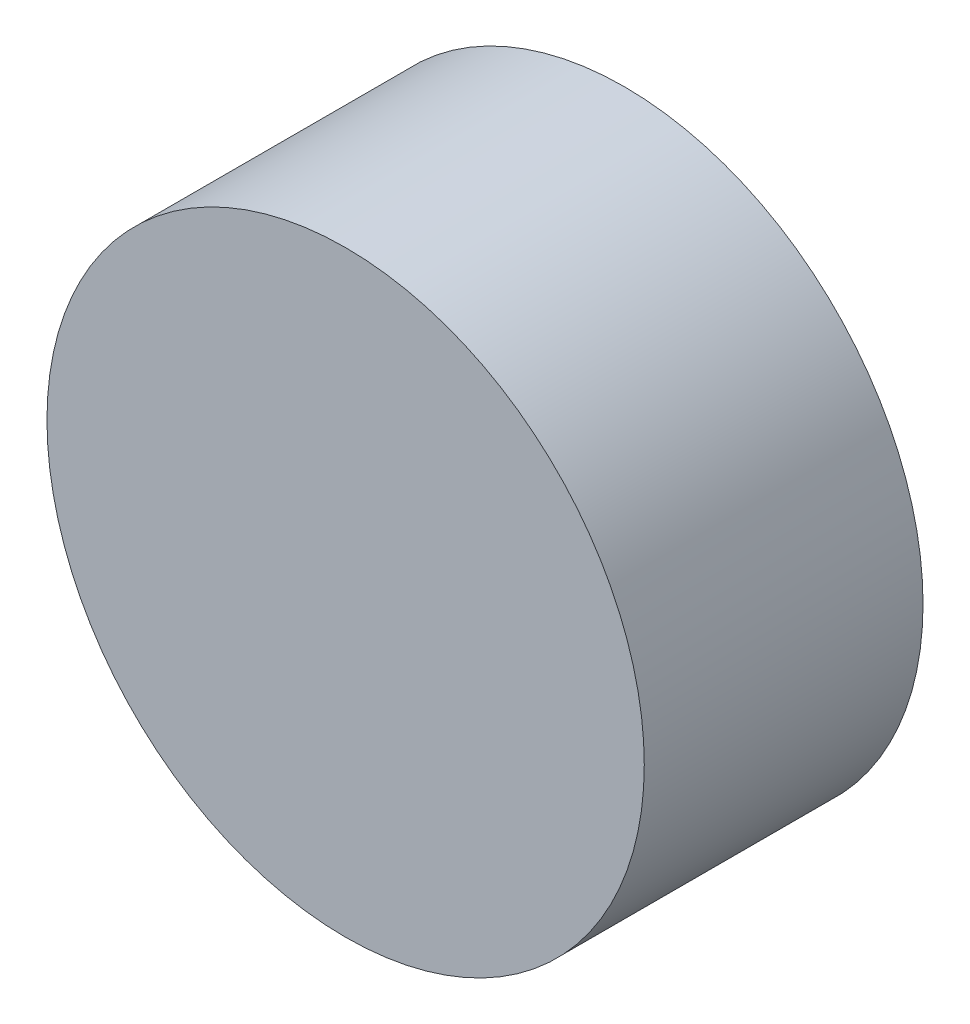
from build123d import *

# Parameters (mm, degrees)
SKETCH_1_R                      = 30
WHEEL_WIDTH28_PLACEHOLDER_DEPTH = 28


with BuildPart() as part:
    # Sketch 1 → Wheel_width28_PLACEHOLDER (new body)
    with BuildSketch(Plane.XY):
        Circle(SKETCH_1_R)
    extrude(amount=WHEEL_WIDTH28_PLACEHOLDER_DEPTH)


solid = part.part
